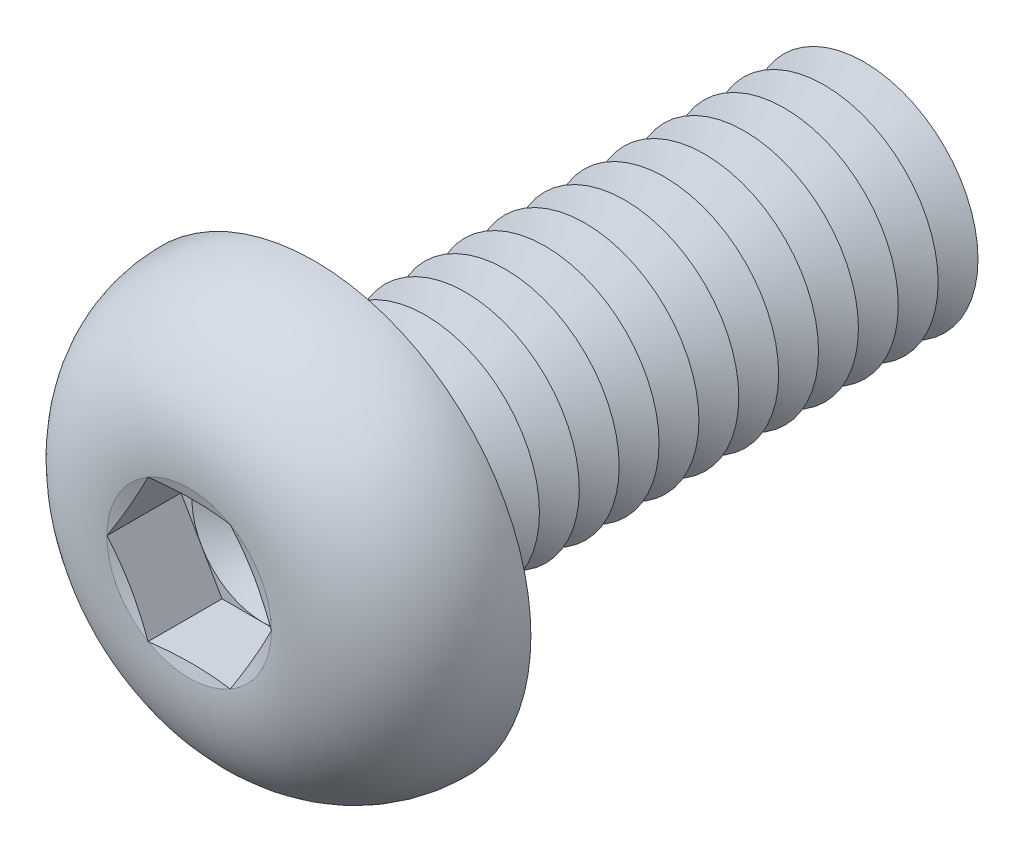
ISO-10303-21;
HEADER;
FILE_DESCRIPTION(('STEP AP214'),'2;1');
FILE_NAME('part.step','',(''),(''),'','','');
FILE_SCHEMA(('AUTOMOTIVE_DESIGN { 1 0 10303 214 1 1 1 1 }'));
ENDSEC;
DATA;
#1=APPLICATION_CONTEXT('core data for automotive mechanical design processes');
#2=APPLICATION_PROTOCOL_DEFINITION('international standard','automotive_design',2000,#1);
#3=PRODUCT_CONTEXT('',#1,'mechanical');
#4=PRODUCT('Part','Part','',(#3));
#5=PRODUCT_RELATED_PRODUCT_CATEGORY('part','',(#4));
#6=PRODUCT_DEFINITION_FORMATION('','',#4);
#7=PRODUCT_DEFINITION_CONTEXT('part definition',#1,'design');
#8=PRODUCT_DEFINITION('design','',#6,#7);
#9=PRODUCT_DEFINITION_SHAPE('','',#8);
#10=(LENGTH_UNIT() NAMED_UNIT(*) SI_UNIT(.MILLI.,.METRE.));
#11=(NAMED_UNIT(*) PLANE_ANGLE_UNIT() SI_UNIT($,.RADIAN.));
#12=(NAMED_UNIT(*) SI_UNIT($,.STERADIAN.) SOLID_ANGLE_UNIT());
#13=UNCERTAINTY_MEASURE_WITH_UNIT(LENGTH_MEASURE(1.E-05),#10,'distance_accuracy_value','');
#14=(GEOMETRIC_REPRESENTATION_CONTEXT(3) GLOBAL_UNCERTAINTY_ASSIGNED_CONTEXT((#13)) GLOBAL_UNIT_ASSIGNED_CONTEXT((#10,
#11,#12)) REPRESENTATION_CONTEXT('',''));
#15=CARTESIAN_POINT('',(0.,0.,0.));
#16=DIRECTION('',(0.,0.,1.));
#17=DIRECTION('',(1.,0.,0.));
#18=AXIS2_PLACEMENT_3D('',#15,#16,#17);
#19=CARTESIAN_POINT('',(0.,0.,0.9));
#20=DIRECTION('',(0.,0.,1.));
#21=DIRECTION('',(1.,0.,0.));
#22=AXIS2_PLACEMENT_3D('',#19,#20,#21);
#23=PLANE('',#22);
#24=CARTESIAN_POINT('',(0.,0.,0.9));
#25=DIRECTION('',(0.,0.,1.));
#26=DIRECTION('',(1.,0.,0.));
#27=AXIS2_PLACEMENT_3D('',#24,#25,#26);
#28=CIRCLE('',#27,1.24999941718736);
#29=CARTESIAN_POINT('',(1.08253125,0.624999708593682,0.9));
#30=VERTEX_POINT('',#29);
#31=CARTESIAN_POINT('',(0.,1.24999941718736,0.9));
#32=VERTEX_POINT('',#31);
#33=EDGE_CURVE('E118',#30,#32,#28,.T.);
#34=ORIENTED_EDGE('',*,*,#33,.F.);
#35=DIRECTION('',(-0.5,0.866025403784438,0.));
#36=VECTOR('',#35,1.);
#37=CARTESIAN_POINT('',(1.443375,0.,0.9));
#38=LINE('',#37,#36);
#39=CARTESIAN_POINT('',(0.7216875,1.24999941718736,0.9));
#40=VERTEX_POINT('',#39);
#41=EDGE_CURVE('E125',#30,#40,#38,.T.);
#42=ORIENTED_EDGE('',*,*,#41,.T.);
#43=DIRECTION('',(-1.,0.,0.));
#44=VECTOR('',#43,1.);
#45=CARTESIAN_POINT('',(0.7216875,1.24999941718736,0.9));
#46=LINE('',#45,#44);
#47=EDGE_CURVE('E136',#40,#32,#46,.T.);
#48=ORIENTED_EDGE('',*,*,#47,.T.);
#49=EDGE_LOOP('',(#34,#42,#48));
#50=FACE_BOUND('',#49,.T.);
#51=ADVANCED_FACE('F39',(#50),#23,.T.);
#52=CARTESIAN_POINT('',(0.,0.,0.9));
#53=DIRECTION('',(0.,0.,1.));
#54=DIRECTION('',(1.,0.,0.));
#55=AXIS2_PLACEMENT_3D('',#52,#53,#54);
#56=CIRCLE('',#55,1.24999941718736);
#57=CARTESIAN_POINT('',(-1.08253125,0.624999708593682,0.9));
#58=VERTEX_POINT('',#57);
#59=EDGE_CURVE('E11',#32,#58,#56,.T.);
#60=ORIENTED_EDGE('',*,*,#59,.F.);
#61=CARTESIAN_POINT('',(-0.721687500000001,1.24999941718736,0.9));
#62=VERTEX_POINT('',#61);
#63=EDGE_CURVE('E131',#32,#62,#46,.T.);
#64=ORIENTED_EDGE('',*,*,#63,.T.);
#65=DIRECTION('',(-0.5,-0.866025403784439,0.));
#66=VECTOR('',#65,1.);
#67=CARTESIAN_POINT('',(-0.721687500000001,1.24999941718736,0.9));
#68=LINE('',#67,#66);
#69=EDGE_CURVE('E134',#62,#58,#68,.T.);
#70=ORIENTED_EDGE('',*,*,#69,.T.);
#71=EDGE_LOOP('',(#60,#64,#70));
#72=FACE_BOUND('',#71,.T.);
#73=ADVANCED_FACE('F130',(#72),#23,.T.);
#74=CARTESIAN_POINT('',(-1.08253125,-0.624999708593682,0.9));
#75=VERTEX_POINT('',#74);
#76=EDGE_CURVE('E49',#58,#75,#56,.T.);
#77=ORIENTED_EDGE('',*,*,#76,.F.);
#78=CARTESIAN_POINT('',(-1.443375,0.,0.9));
#79=VERTEX_POINT('',#78);
#80=EDGE_CURVE('E143',#58,#79,#68,.T.);
#81=ORIENTED_EDGE('',*,*,#80,.T.);
#82=DIRECTION('',(0.5,-0.866025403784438,0.));
#83=VECTOR('',#82,1.);
#84=CARTESIAN_POINT('',(-1.443375,0.,0.9));
#85=LINE('',#84,#83);
#86=EDGE_CURVE('E152',#79,#75,#85,.T.);
#87=ORIENTED_EDGE('',*,*,#86,.T.);
#88=EDGE_LOOP('',(#77,#81,#87));
#89=FACE_BOUND('',#88,.T.);
#90=ADVANCED_FACE('F387',(#89),#23,.T.);
#91=CARTESIAN_POINT('',(0.,-1.24999941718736,0.9));
#92=VERTEX_POINT('',#91);
#93=EDGE_CURVE('E369',#75,#92,#56,.T.);
#94=ORIENTED_EDGE('',*,*,#93,.F.);
#95=CARTESIAN_POINT('',(-0.721687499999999,-1.24999941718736,0.9));
#96=VERTEX_POINT('',#95);
#97=EDGE_CURVE('E151',#75,#96,#85,.T.);
#98=ORIENTED_EDGE('',*,*,#97,.T.);
#99=DIRECTION('',(1.,0.,0.));
#100=VECTOR('',#99,1.);
#101=CARTESIAN_POINT('',(-0.721687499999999,-1.24999941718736,0.9));
#102=LINE('',#101,#100);
#103=EDGE_CURVE('E157',#96,#92,#102,.T.);
#104=ORIENTED_EDGE('',*,*,#103,.T.);
#105=EDGE_LOOP('',(#94,#98,#104));
#106=FACE_BOUND('',#105,.T.);
#107=ADVANCED_FACE('F381',(#106),#23,.T.);
#108=CARTESIAN_POINT('',(1.08253125,-0.624999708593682,0.9));
#109=VERTEX_POINT('',#108);
#110=EDGE_CURVE('E56',#92,#109,#56,.T.);
#111=ORIENTED_EDGE('',*,*,#110,.F.);
#112=CARTESIAN_POINT('',(0.721687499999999,-1.24999941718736,0.9));
#113=VERTEX_POINT('',#112);
#114=EDGE_CURVE('E156',#92,#113,#102,.T.);
#115=ORIENTED_EDGE('',*,*,#114,.T.);
#116=DIRECTION('',(0.5,0.866025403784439,0.));
#117=VECTOR('',#116,1.);
#118=CARTESIAN_POINT('',(0.721687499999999,-1.24999941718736,0.9));
#119=LINE('',#118,#117);
#120=EDGE_CURVE('E162',#113,#109,#119,.T.);
#121=ORIENTED_EDGE('',*,*,#120,.T.);
#122=EDGE_LOOP('',(#111,#115,#121));
#123=FACE_BOUND('',#122,.T.);
#124=ADVANCED_FACE('F452',(#123),#23,.T.);
#125=CARTESIAN_POINT('',(0.,0.,2.2));
#126=DIRECTION('',(0.,0.,1.));
#127=DIRECTION('',(1.,0.,0.));
#128=AXIS2_PLACEMENT_3D('',#125,#126,#127);
#129=CONICAL_SURFACE('',#128,1.443375,1.30899693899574);
#130=CARTESIAN_POINT('',(1.44349047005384,-0.000199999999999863,2.20003094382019));
#131=CARTESIAN_POINT('',(1.41351104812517,0.0517258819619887,2.19199301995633));
#132=CARTESIAN_POINT('',(1.38347725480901,0.10374593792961,2.18469579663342));
#133=CARTESIAN_POINT('',(1.32330355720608,0.207969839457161,2.17187512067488));
#134=CARTESIAN_POINT('',(1.29316361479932,0.260173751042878,2.16635238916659));
#135=CARTESIAN_POINT('',(1.23296043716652,0.364448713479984,2.15740323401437));
#136=CARTESIAN_POINT('',(1.20289760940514,0.416519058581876,2.15396613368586));
#137=CARTESIAN_POINT('',(1.14273359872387,0.520726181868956,2.14935732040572));
#138=CARTESIAN_POINT('',(1.11263242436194,0.572862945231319,2.14818516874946));
#139=CARTESIAN_POINT('',(1.05243007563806,0.677136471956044,2.14818516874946));
#140=CARTESIAN_POINT('',(1.02232890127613,0.729273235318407,2.14935732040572));
#141=CARTESIAN_POINT('',(0.962164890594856,0.833480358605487,2.15396613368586));
#142=CARTESIAN_POINT('',(0.932102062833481,0.885550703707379,2.15740323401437));
#143=CARTESIAN_POINT('',(0.87189888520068,0.989825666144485,2.16635238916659));
#144=CARTESIAN_POINT('',(0.841758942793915,1.0420295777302,2.17187512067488));
#145=CARTESIAN_POINT('',(0.781585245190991,1.14625347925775,2.18469579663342));
#146=CARTESIAN_POINT('',(0.751551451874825,1.19827353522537,2.19199301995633));
#147=CARTESIAN_POINT('',(0.721572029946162,1.25019941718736,2.20003094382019));
#148=B_SPLINE_CURVE_WITH_KNOTS('',3,(#130,#131,#132,#133,#134,#135,#136,#137,#138,#139,#140,
#141,#142,#143,#144,#145,#146,#147),.UNSPECIFIED.,.F.,.F.,(4,2,2,2,2,2,2,2,4),(0.,
0.181495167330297,0.363063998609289,0.543695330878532,0.724291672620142,0.904888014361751,
1.08551934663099,1.26708817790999,1.44858334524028),.UNSPECIFIED.);
#149=CARTESIAN_POINT('',(1.443375,0.,2.2));
#150=VERTEX_POINT('',#149);
#151=CARTESIAN_POINT('',(0.721687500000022,1.24999941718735,2.2));
#152=VERTEX_POINT('',#151);
#153=EDGE_CURVE('E222',#150,#152,#148,.T.);
#154=ORIENTED_EDGE('',*,*,#153,.F.);
#155=CARTESIAN_POINT('',(0.,0.,2.2));
#156=DIRECTION('',(0.,0.,-1.));
#157=DIRECTION('',(-1.,0.,0.));
#158=AXIS2_PLACEMENT_3D('',#155,#156,#157);
#159=CIRCLE('',#158,1.443375);
#160=EDGE_CURVE('E417',#152,#150,#159,.T.);
#161=ORIENTED_EDGE('',*,*,#160,.F.);
#162=EDGE_LOOP('',(#154,#161));
#163=FACE_BOUND('',#162,.T.);
#164=ADVANCED_FACE('F456',(#163),#129,.F.);
#165=CARTESIAN_POINT('',(0.721572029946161,-1.25019941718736,2.20003094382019));
#166=CARTESIAN_POINT('',(0.751551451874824,-1.19827353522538,2.19199301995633));
#167=CARTESIAN_POINT('',(0.78158524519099,-1.14625347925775,2.18469579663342));
#168=CARTESIAN_POINT('',(0.841758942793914,-1.0420295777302,2.17187512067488));
#169=CARTESIAN_POINT('',(0.87189888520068,-0.989825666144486,2.16635238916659));
#170=CARTESIAN_POINT('',(0.932102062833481,-0.88555070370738,2.15740323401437));
#171=CARTESIAN_POINT('',(0.962164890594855,-0.833480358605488,2.15396613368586));
#172=CARTESIAN_POINT('',(1.02232890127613,-0.729273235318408,2.14935732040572));
#173=CARTESIAN_POINT('',(1.05243007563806,-0.677136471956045,2.14818516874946));
#174=CARTESIAN_POINT('',(1.11263242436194,-0.572862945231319,2.14818516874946));
#175=CARTESIAN_POINT('',(1.14273359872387,-0.520726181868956,2.14935732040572));
#176=CARTESIAN_POINT('',(1.20289760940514,-0.416519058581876,2.15396613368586));
#177=CARTESIAN_POINT('',(1.23296043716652,-0.364448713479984,2.15740323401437));
#178=CARTESIAN_POINT('',(1.29316361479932,-0.260173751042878,2.16635238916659));
#179=CARTESIAN_POINT('',(1.32330355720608,-0.207969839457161,2.17187512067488));
#180=CARTESIAN_POINT('',(1.38347725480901,-0.10374593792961,2.18469579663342));
#181=CARTESIAN_POINT('',(1.41351104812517,-0.0517258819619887,2.19199301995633));
#182=CARTESIAN_POINT('',(1.44349047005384,0.000199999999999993,2.20003094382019));
#183=B_SPLINE_CURVE_WITH_KNOTS('',3,(#165,#166,#167,#168,#169,#170,#171,#172,#173,#174,#175,
#176,#177,#178,#179,#180,#181,#182),.UNSPECIFIED.,.F.,.F.,(4,2,2,2,2,2,2,2,4),(0.,
0.181495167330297,0.36306399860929,0.543695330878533,0.724291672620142,0.904888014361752,
1.085519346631,1.26708817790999,1.44858334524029),.UNSPECIFIED.);
#184=CARTESIAN_POINT('',(0.721687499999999,-1.24999941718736,2.2));
#185=VERTEX_POINT('',#184);
#186=EDGE_CURVE('E231',#185,#150,#183,.T.);
#187=ORIENTED_EDGE('',*,*,#186,.F.);
#188=EDGE_CURVE('E418',#150,#185,#159,.T.);
#189=ORIENTED_EDGE('',*,*,#188,.F.);
#190=EDGE_LOOP('',(#187,#189));
#191=FACE_BOUND('',#190,.T.);
#192=ADVANCED_FACE('F462',(#191),#129,.F.);
#193=CARTESIAN_POINT('',(-2.17815859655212,-1.24999941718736,2.48616275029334));
#194=CARTESIAN_POINT('',(-2.07269794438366,-1.24999941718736,2.4616881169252));
#195=CARTESIAN_POINT('',(-1.96714913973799,-1.24999941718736,2.43756889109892));
#196=CARTESIAN_POINT('',(-1.75576352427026,-1.24999941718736,2.39052699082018));
#197=CARTESIAN_POINT('',(-1.64992665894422,-1.24999941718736,2.36760456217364));
#198=CARTESIAN_POINT('',(-1.43690237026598,-1.24999941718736,2.3232454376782));
#199=CARTESIAN_POINT('',(-1.32971158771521,-1.24999941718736,2.30182468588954));
#200=CARTESIAN_POINT('',(-1.1148274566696,-1.24999941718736,2.26156703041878));
#201=CARTESIAN_POINT('',(-1.00713406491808,-1.24999941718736,2.24273035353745));
#202=CARTESIAN_POINT('',(-0.794044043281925,-1.24999941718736,2.2093913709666));
#203=CARTESIAN_POINT('',(-0.688664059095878,-1.24999941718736,2.19478562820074));
#204=CARTESIAN_POINT('',(-0.477310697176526,-1.24999941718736,2.17085809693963));
#205=CARTESIAN_POINT('',(-0.371337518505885,-1.24999941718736,2.16153463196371));
#206=CARTESIAN_POINT('',(-0.159455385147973,-1.24999941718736,2.14976770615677));
#207=CARTESIAN_POINT('',(-0.0535482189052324,-1.24999941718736,2.14729400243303));
#208=CARTESIAN_POINT('',(0.158189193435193,-1.24999941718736,2.14966287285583));
#209=CARTESIAN_POINT('',(0.264019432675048,-1.24999941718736,2.15450603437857));
#210=CARTESIAN_POINT('',(0.445148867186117,-1.24999941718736,2.16825380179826));
#211=CARTESIAN_POINT('',(0.520574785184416,-1.24999941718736,2.17561242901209));
#212=CARTESIAN_POINT('',(0.671115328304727,-1.24999941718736,2.19297000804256));
#213=CARTESIAN_POINT('',(0.746229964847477,-1.24999941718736,2.20296886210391));
#214=CARTESIAN_POINT('',(0.896387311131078,-1.24999941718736,2.22505910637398));
#215=CARTESIAN_POINT('',(0.971429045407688,-1.24999941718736,2.23715700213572));
#216=CARTESIAN_POINT('',(1.12124320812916,-1.24999941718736,2.26292371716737));
#217=CARTESIAN_POINT('',(1.19601562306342,-1.24999941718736,2.27659261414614));
#218=CARTESIAN_POINT('',(1.34686913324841,-1.24999941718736,2.30540811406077));
#219=CARTESIAN_POINT('',(1.42294548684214,-1.24999941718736,2.32057934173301));
#220=CARTESIAN_POINT('',(1.57490676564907,-1.24999941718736,2.351851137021));
#221=CARTESIAN_POINT('',(1.65079168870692,-1.24999941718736,2.36795171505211));
#222=CARTESIAN_POINT('',(1.80199501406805,-1.24999941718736,2.40076814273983));
#223=CARTESIAN_POINT('',(1.87731425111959,-1.24999941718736,2.41748016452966));
#224=CARTESIAN_POINT('',(2.02782424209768,-1.24999941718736,2.45144971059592));
#225=CARTESIAN_POINT('',(2.10301500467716,-1.24999941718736,2.46870719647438));
#226=CARTESIAN_POINT('',(2.17815859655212,-1.24999941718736,2.48616275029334));
#227=B_SPLINE_CURVE_WITH_KNOTS('',3,(#193,#194,#195,#196,#197,#198,#199,#200,#201,#202,#203,
#204,#205,#206,#207,#208,#209,#210,#211,#212,#213,#214,#215,#216,#217,#218,#219,#220,#221,#222,
#223,#224,#225,#226),.UNSPECIFIED.,.F.,.F.,(4,2,2,2,2,2,2,2,2,2,2,2,2,2,2,2,4),(0.,
0.324797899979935,0.649662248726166,0.977572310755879,1.30551113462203,1.62458166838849,
1.94355087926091,2.26110952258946,2.57869365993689,2.80599541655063,3.03328875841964,
3.2612995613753,3.48932164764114,3.7220371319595,3.95475522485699,4.18620606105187,
4.41764064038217),.UNSPECIFIED.);
#228=CARTESIAN_POINT('',(-0.721687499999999,-1.24999941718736,2.2));
#229=VERTEX_POINT('',#228);
#230=EDGE_CURVE('E399',#229,#185,#227,.T.);
#231=ORIENTED_EDGE('',*,*,#230,.F.);
#232=EDGE_CURVE('E407',#185,#229,#159,.T.);
#233=ORIENTED_EDGE('',*,*,#232,.F.);
#234=EDGE_LOOP('',(#231,#233));
#235=FACE_BOUND('',#234,.T.);
#236=ADVANCED_FACE('F476',(#235),#129,.F.);
#237=CARTESIAN_POINT('',(-1.44349047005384,0.000200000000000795,2.20003094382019));
#238=CARTESIAN_POINT('',(-1.41351104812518,-0.0517258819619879,2.19199301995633));
#239=CARTESIAN_POINT('',(-1.38347725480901,-0.10374593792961,2.18469579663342));
#240=CARTESIAN_POINT('',(-1.32330355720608,-0.20796983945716,2.17187512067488));
#241=CARTESIAN_POINT('',(-1.29316361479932,-0.260173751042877,2.16635238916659));
#242=CARTESIAN_POINT('',(-1.23296043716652,-0.364448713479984,2.15740323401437));
#243=CARTESIAN_POINT('',(-1.20289760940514,-0.416519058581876,2.15396613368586));
#244=CARTESIAN_POINT('',(-1.14273359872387,-0.520726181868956,2.14935732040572));
#245=CARTESIAN_POINT('',(-1.11263242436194,-0.572862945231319,2.14818516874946));
#246=CARTESIAN_POINT('',(-1.05243007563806,-0.677136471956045,2.14818516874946));
#247=CARTESIAN_POINT('',(-1.02232890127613,-0.729273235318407,2.14935732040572));
#248=CARTESIAN_POINT('',(-0.962164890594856,-0.833480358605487,2.15396613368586));
#249=CARTESIAN_POINT('',(-0.932102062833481,-0.885550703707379,2.15740323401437));
#250=CARTESIAN_POINT('',(-0.87189888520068,-0.989825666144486,2.16635238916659));
#251=CARTESIAN_POINT('',(-0.841758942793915,-1.0420295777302,2.17187512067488));
#252=CARTESIAN_POINT('',(-0.78158524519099,-1.14625347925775,2.18469579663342));
#253=CARTESIAN_POINT('',(-0.751551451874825,-1.19827353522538,2.19199301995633));
#254=CARTESIAN_POINT('',(-0.721572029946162,-1.25019941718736,2.20003094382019));
#255=B_SPLINE_CURVE_WITH_KNOTS('',3,(#237,#238,#239,#240,#241,#242,#243,#244,#245,#246,#247,
#248,#249,#250,#251,#252,#253,#254),.UNSPECIFIED.,.F.,.F.,(4,2,2,2,2,2,2,2,4),(0.,
0.181495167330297,0.36306399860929,0.543695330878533,0.724291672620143,0.904888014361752,
1.085519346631,1.26708817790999,1.44858334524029),.UNSPECIFIED.);
#256=CARTESIAN_POINT('',(-1.443375,0.,2.2));
#257=VERTEX_POINT('',#256);
#258=EDGE_CURVE('E392',#257,#229,#255,.T.);
#259=ORIENTED_EDGE('',*,*,#258,.F.);
#260=EDGE_CURVE('E348',#229,#257,#159,.T.);
#261=ORIENTED_EDGE('',*,*,#260,.F.);
#262=EDGE_LOOP('',(#259,#261));
#263=FACE_BOUND('',#262,.T.);
#264=ADVANCED_FACE('F396',(#263),#129,.F.);
#265=CARTESIAN_POINT('',(-0.721572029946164,1.25019941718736,2.20003094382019));
#266=CARTESIAN_POINT('',(-0.751551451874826,1.19827353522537,2.19199301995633));
#267=CARTESIAN_POINT('',(-0.781585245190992,1.14625347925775,2.18469579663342));
#268=CARTESIAN_POINT('',(-0.841758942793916,1.0420295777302,2.17187512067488));
#269=CARTESIAN_POINT('',(-0.871898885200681,0.989825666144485,2.16635238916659));
#270=CARTESIAN_POINT('',(-0.932102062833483,0.885550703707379,2.15740323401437));
#271=CARTESIAN_POINT('',(-0.962164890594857,0.833480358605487,2.15396613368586));
#272=CARTESIAN_POINT('',(-1.02232890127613,0.729273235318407,2.14935732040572));
#273=CARTESIAN_POINT('',(-1.05243007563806,0.677136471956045,2.14818516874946));
#274=CARTESIAN_POINT('',(-1.11263242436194,0.572862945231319,2.14818516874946));
#275=CARTESIAN_POINT('',(-1.14273359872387,0.520726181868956,2.14935732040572));
#276=CARTESIAN_POINT('',(-1.20289760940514,0.416519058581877,2.15396613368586));
#277=CARTESIAN_POINT('',(-1.23296043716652,0.364448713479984,2.15740323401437));
#278=CARTESIAN_POINT('',(-1.29316361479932,0.260173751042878,2.16635238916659));
#279=CARTESIAN_POINT('',(-1.32330355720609,0.207969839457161,2.17187512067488));
#280=CARTESIAN_POINT('',(-1.38347725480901,0.103745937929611,2.18469579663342));
#281=CARTESIAN_POINT('',(-1.41351104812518,0.0517258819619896,2.19199301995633));
#282=CARTESIAN_POINT('',(-1.44349047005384,-0.00019999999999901,2.20003094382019));
#283=B_SPLINE_CURVE_WITH_KNOTS('',3,(#265,#266,#267,#268,#269,#270,#271,#272,#273,#274,#275,
#276,#277,#278,#279,#280,#281,#282),.UNSPECIFIED.,.F.,.F.,(4,2,2,2,2,2,2,2,4),(0.,
0.181495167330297,0.363063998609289,0.543695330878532,0.724291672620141,0.90488801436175,
1.08551934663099,1.26708817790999,1.44858334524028),.UNSPECIFIED.);
#284=CARTESIAN_POINT('',(-0.721687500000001,1.24999941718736,2.2));
#285=VERTEX_POINT('',#284);
#286=EDGE_CURVE('E195',#285,#257,#283,.T.);
#287=ORIENTED_EDGE('',*,*,#286,.F.);
#288=EDGE_CURVE('E349',#257,#285,#159,.T.);
#289=ORIENTED_EDGE('',*,*,#288,.F.);
#290=EDGE_LOOP('',(#287,#289));
#291=FACE_BOUND('',#290,.T.);
#292=ADVANCED_FACE('F410',(#291),#129,.F.);
#293=CARTESIAN_POINT('',(0.,0.,-7.55));
#294=DIRECTION('',(0.,0.,1.));
#295=DIRECTION('',(1.,0.,0.));
#296=AXIS2_PLACEMENT_3D('',#293,#294,#295);
#297=CONICAL_SURFACE('',#296,2.,1.0471975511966);
#298=CARTESIAN_POINT('',(0.,0.,-7.9));
#299=DIRECTION('',(0.,0.,1.));
#300=DIRECTION('',(1.,0.,0.));
#301=AXIS2_PLACEMENT_3D('',#298,#299,#300);
#302=CIRCLE('',#301,1.3937822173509);
#303=CARTESIAN_POINT('',(1.3937822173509,0.,-7.9));
#304=VERTEX_POINT('',#303);
#305=EDGE_CURVE('E320',#304,#304,#302,.T.);
#306=ORIENTED_EDGE('',*,*,#305,.T.);
#307=EDGE_LOOP('',(#306));
#308=FACE_BOUND('',#307,.T.);
#309=CARTESIAN_POINT('',(0.,0.,-7.55));
#310=DIRECTION('',(0.,0.,1.));
#311=DIRECTION('',(1.,0.,0.));
#312=AXIS2_PLACEMENT_3D('',#309,#310,#311);
#313=CIRCLE('',#312,2.);
#314=CARTESIAN_POINT('',(2.,0.,-7.55));
#315=VERTEX_POINT('',#314);
#316=EDGE_CURVE('E316',#315,#315,#313,.T.);
#317=ORIENTED_EDGE('',*,*,#316,.F.);
#318=EDGE_LOOP('',(#317));
#319=FACE_BOUND('',#318,.T.);
#320=ADVANCED_FACE('F542',(#308,#319),#297,.T.);
#321=CARTESIAN_POINT('',(0.,0.,-7.9));
#322=DIRECTION('',(0.,0.,-1.));
#323=DIRECTION('',(-1.,0.,0.));
#324=AXIS2_PLACEMENT_3D('',#321,#322,#323);
#325=CONICAL_SURFACE('',#324,1.3937822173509,1.0471975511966);
#326=CARTESIAN_POINT('',(0.,0.,-8.25));
#327=DIRECTION('',(0.,0.,1.));
#328=DIRECTION('',(1.,0.,0.));
#329=AXIS2_PLACEMENT_3D('',#326,#327,#328);
#330=CIRCLE('',#329,2.);
#331=CARTESIAN_POINT('',(2.,0.,-8.25));
#332=VERTEX_POINT('',#331);
#333=EDGE_CURVE('E324',#332,#332,#330,.T.);
#334=ORIENTED_EDGE('',*,*,#333,.T.);
#335=EDGE_LOOP('',(#334));
#336=FACE_BOUND('',#335,.T.);
#337=ORIENTED_EDGE('',*,*,#305,.F.);
#338=EDGE_LOOP('',(#337));
#339=FACE_BOUND('',#338,.T.);
#340=ADVANCED_FACE('F817',(#336,#339),#325,.T.);
#341=CARTESIAN_POINT('',(0.,2.00000000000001,-10.));
#342=DIRECTION('',(0.,0.,-1.));
#343=DIRECTION('',(-1.,0.,0.));
#344=AXIS2_PLACEMENT_3D('',#341,#342,#343);
#345=PLANE('',#344);
#346=CARTESIAN_POINT('',(0.,0.,-10.));
#347=DIRECTION('',(0.,0.,1.));
#348=DIRECTION('',(1.,0.,0.));
#349=AXIS2_PLACEMENT_3D('',#346,#347,#348);
#350=CIRCLE('',#349,1.3937822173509);
#351=CARTESIAN_POINT('',(1.3937822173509,0.,-10.));
#352=VERTEX_POINT('',#351);
#353=EDGE_CURVE('E344',#352,#352,#350,.T.);
#354=ORIENTED_EDGE('',*,*,#353,.F.);
#355=EDGE_LOOP('',(#354));
#356=FACE_BOUND('',#355,.T.);
#357=ADVANCED_FACE('F811',(#356),#345,.T.);
#358=CARTESIAN_POINT('',(0.,0.,-9.65));
#359=DIRECTION('',(0.,0.,1.));
#360=DIRECTION('',(1.,0.,0.));
#361=AXIS2_PLACEMENT_3D('',#358,#359,#360);
#362=CONICAL_SURFACE('',#361,2.,1.0471975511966);
#363=ORIENTED_EDGE('',*,*,#353,.T.);
#364=EDGE_LOOP('',(#363));
#365=FACE_BOUND('',#364,.T.);
#366=CARTESIAN_POINT('',(0.,0.,-9.65));
#367=DIRECTION('',(0.,0.,1.));
#368=DIRECTION('',(1.,0.,0.));
#369=AXIS2_PLACEMENT_3D('',#366,#367,#368);
#370=CIRCLE('',#369,2.);
#371=CARTESIAN_POINT('',(2.,0.,-9.65));
#372=VERTEX_POINT('',#371);
#373=EDGE_CURVE('E340',#372,#372,#370,.T.);
#374=ORIENTED_EDGE('',*,*,#373,.F.);
#375=EDGE_LOOP('',(#374));
#376=FACE_BOUND('',#375,.T.);
#377=ADVANCED_FACE('F804',(#365,#376),#362,.T.);
#378=CARTESIAN_POINT('',(0.,0.,-9.3));
#379=DIRECTION('',(0.,0.,-1.));
#380=DIRECTION('',(-1.,0.,0.));
#381=AXIS2_PLACEMENT_3D('',#378,#379,#380);
#382=CONICAL_SURFACE('',#381,1.3937822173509,1.0471975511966);
#383=ORIENTED_EDGE('',*,*,#373,.T.);
#384=EDGE_LOOP('',(#383));
#385=FACE_BOUND('',#384,.T.);
#386=CARTESIAN_POINT('',(0.,0.,-9.3));
#387=DIRECTION('',(0.,0.,1.));
#388=DIRECTION('',(1.,0.,0.));
#389=AXIS2_PLACEMENT_3D('',#386,#387,#388);
#390=CIRCLE('',#389,1.3937822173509);
#391=CARTESIAN_POINT('',(1.3937822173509,0.,-9.3));
#392=VERTEX_POINT('',#391);
#393=EDGE_CURVE('E336',#392,#392,#390,.T.);
#394=ORIENTED_EDGE('',*,*,#393,.F.);
#395=EDGE_LOOP('',(#394));
#396=FACE_BOUND('',#395,.T.);
#397=ADVANCED_FACE('F797',(#385,#396),#382,.T.);
#398=CARTESIAN_POINT('',(0.,0.,-8.95));
#399=DIRECTION('',(0.,0.,1.));
#400=DIRECTION('',(1.,0.,0.));
#401=AXIS2_PLACEMENT_3D('',#398,#399,#400);
#402=CONICAL_SURFACE('',#401,2.,1.0471975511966);
#403=ORIENTED_EDGE('',*,*,#393,.T.);
#404=EDGE_LOOP('',(#403));
#405=FACE_BOUND('',#404,.T.);
#406=CARTESIAN_POINT('',(0.,0.,-8.95));
#407=DIRECTION('',(0.,0.,1.));
#408=DIRECTION('',(1.,0.,0.));
#409=AXIS2_PLACEMENT_3D('',#406,#407,#408);
#410=CIRCLE('',#409,2.);
#411=CARTESIAN_POINT('',(2.,0.,-8.95));
#412=VERTEX_POINT('',#411);
#413=EDGE_CURVE('E332',#412,#412,#410,.T.);
#414=ORIENTED_EDGE('',*,*,#413,.F.);
#415=EDGE_LOOP('',(#414));
#416=FACE_BOUND('',#415,.T.);
#417=ADVANCED_FACE('F790',(#405,#416),#402,.T.);
#418=CARTESIAN_POINT('',(0.,0.,-8.6));
#419=DIRECTION('',(0.,0.,-1.));
#420=DIRECTION('',(-1.,0.,0.));
#421=AXIS2_PLACEMENT_3D('',#418,#419,#420);
#422=CONICAL_SURFACE('',#421,1.3937822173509,1.0471975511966);
#423=ORIENTED_EDGE('',*,*,#413,.T.);
#424=EDGE_LOOP('',(#423));
#425=FACE_BOUND('',#424,.T.);
#426=CARTESIAN_POINT('',(0.,0.,-8.6));
#427=DIRECTION('',(0.,0.,1.));
#428=DIRECTION('',(1.,0.,0.));
#429=AXIS2_PLACEMENT_3D('',#426,#427,#428);
#430=CIRCLE('',#429,1.3937822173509);
#431=CARTESIAN_POINT('',(1.3937822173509,0.,-8.6));
#432=VERTEX_POINT('',#431);
#433=EDGE_CURVE('E328',#432,#432,#430,.T.);
#434=ORIENTED_EDGE('',*,*,#433,.F.);
#435=EDGE_LOOP('',(#434));
#436=FACE_BOUND('',#435,.T.);
#437=ADVANCED_FACE('F783',(#425,#436),#422,.T.);
#438=CARTESIAN_POINT('',(0.,0.,-8.25));
#439=DIRECTION('',(0.,0.,1.));
#440=DIRECTION('',(1.,0.,0.));
#441=AXIS2_PLACEMENT_3D('',#438,#439,#440);
#442=CONICAL_SURFACE('',#441,2.,1.0471975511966);
#443=ORIENTED_EDGE('',*,*,#433,.T.);
#444=EDGE_LOOP('',(#443));
#445=FACE_BOUND('',#444,.T.);
#446=ORIENTED_EDGE('',*,*,#333,.F.);
#447=EDGE_LOOP('',(#446));
#448=FACE_BOUND('',#447,.T.);
#449=ADVANCED_FACE('F776',(#445,#448),#442,.T.);
#450=CARTESIAN_POINT('',(0.,0.,-6.85));
#451=DIRECTION('',(0.,0.,1.));
#452=DIRECTION('',(1.,0.,0.));
#453=AXIS2_PLACEMENT_3D('',#450,#451,#452);
#454=CONICAL_SURFACE('',#453,2.,1.0471975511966);
#455=CARTESIAN_POINT('',(0.,0.,-7.2));
#456=DIRECTION('',(0.,0.,1.));
#457=DIRECTION('',(1.,0.,0.));
#458=AXIS2_PLACEMENT_3D('',#455,#456,#457);
#459=CIRCLE('',#458,1.3937822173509);
#460=CARTESIAN_POINT('',(1.3937822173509,0.,-7.2));
#461=VERTEX_POINT('',#460);
#462=EDGE_CURVE('E312',#461,#461,#459,.T.);
#463=ORIENTED_EDGE('',*,*,#462,.T.);
#464=EDGE_LOOP('',(#463));
#465=FACE_BOUND('',#464,.T.);
#466=CARTESIAN_POINT('',(0.,0.,-6.85));
#467=DIRECTION('',(0.,0.,1.));
#468=DIRECTION('',(1.,0.,0.));
#469=AXIS2_PLACEMENT_3D('',#466,#467,#468);
#470=CIRCLE('',#469,2.);
#471=CARTESIAN_POINT('',(2.,0.,-6.85));
#472=VERTEX_POINT('',#471);
#473=EDGE_CURVE('E308',#472,#472,#470,.T.);
#474=ORIENTED_EDGE('',*,*,#473,.F.);
#475=EDGE_LOOP('',(#474));
#476=FACE_BOUND('',#475,.T.);
#477=ADVANCED_FACE('F769',(#465,#476),#454,.T.);
#478=CARTESIAN_POINT('',(0.,0.,-7.2));
#479=DIRECTION('',(0.,0.,-1.));
#480=DIRECTION('',(-1.,0.,0.));
#481=AXIS2_PLACEMENT_3D('',#478,#479,#480);
#482=CONICAL_SURFACE('',#481,1.3937822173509,1.0471975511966);
#483=ORIENTED_EDGE('',*,*,#316,.T.);
#484=EDGE_LOOP('',(#483));
#485=FACE_BOUND('',#484,.T.);
#486=ORIENTED_EDGE('',*,*,#462,.F.);
#487=EDGE_LOOP('',(#486));
#488=FACE_BOUND('',#487,.T.);
#489=ADVANCED_FACE('F762',(#485,#488),#482,.T.);
#490=CARTESIAN_POINT('',(0.,0.,-6.15));
#491=DIRECTION('',(0.,0.,1.));
#492=DIRECTION('',(1.,0.,0.));
#493=AXIS2_PLACEMENT_3D('',#490,#491,#492);
#494=CONICAL_SURFACE('',#493,2.,1.0471975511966);
#495=CARTESIAN_POINT('',(0.,0.,-6.5));
#496=DIRECTION('',(0.,0.,1.));
#497=DIRECTION('',(1.,0.,0.));
#498=AXIS2_PLACEMENT_3D('',#495,#496,#497);
#499=CIRCLE('',#498,1.3937822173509);
#500=CARTESIAN_POINT('',(1.3937822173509,0.,-6.5));
#501=VERTEX_POINT('',#500);
#502=EDGE_CURVE('E304',#501,#501,#499,.T.);
#503=ORIENTED_EDGE('',*,*,#502,.T.);
#504=EDGE_LOOP('',(#503));
#505=FACE_BOUND('',#504,.T.);
#506=CARTESIAN_POINT('',(0.,0.,-6.15));
#507=DIRECTION('',(0.,0.,1.));
#508=DIRECTION('',(1.,0.,0.));
#509=AXIS2_PLACEMENT_3D('',#506,#507,#508);
#510=CIRCLE('',#509,2.);
#511=CARTESIAN_POINT('',(2.,0.,-6.15));
#512=VERTEX_POINT('',#511);
#513=EDGE_CURVE('E300',#512,#512,#510,.T.);
#514=ORIENTED_EDGE('',*,*,#513,.F.);
#515=EDGE_LOOP('',(#514));
#516=FACE_BOUND('',#515,.T.);
#517=ADVANCED_FACE('F755',(#505,#516),#494,.T.);
#518=CARTESIAN_POINT('',(0.,0.,-6.5));
#519=DIRECTION('',(0.,0.,-1.));
#520=DIRECTION('',(-1.,0.,0.));
#521=AXIS2_PLACEMENT_3D('',#518,#519,#520);
#522=CONICAL_SURFACE('',#521,1.3937822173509,1.0471975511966);
#523=ORIENTED_EDGE('',*,*,#473,.T.);
#524=EDGE_LOOP('',(#523));
#525=FACE_BOUND('',#524,.T.);
#526=ORIENTED_EDGE('',*,*,#502,.F.);
#527=EDGE_LOOP('',(#526));
#528=FACE_BOUND('',#527,.T.);
#529=ADVANCED_FACE('F748',(#525,#528),#522,.T.);
#530=CARTESIAN_POINT('',(0.,0.,-5.45));
#531=DIRECTION('',(0.,0.,1.));
#532=DIRECTION('',(1.,0.,0.));
#533=AXIS2_PLACEMENT_3D('',#530,#531,#532);
#534=CONICAL_SURFACE('',#533,2.,1.0471975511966);
#535=CARTESIAN_POINT('',(0.,0.,-5.8));
#536=DIRECTION('',(0.,0.,1.));
#537=DIRECTION('',(1.,0.,0.));
#538=AXIS2_PLACEMENT_3D('',#535,#536,#537);
#539=CIRCLE('',#538,1.3937822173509);
#540=CARTESIAN_POINT('',(1.3937822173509,0.,-5.8));
#541=VERTEX_POINT('',#540);
#542=EDGE_CURVE('E296',#541,#541,#539,.T.);
#543=ORIENTED_EDGE('',*,*,#542,.T.);
#544=EDGE_LOOP('',(#543));
#545=FACE_BOUND('',#544,.T.);
#546=CARTESIAN_POINT('',(0.,0.,-5.45));
#547=DIRECTION('',(0.,0.,1.));
#548=DIRECTION('',(1.,0.,0.));
#549=AXIS2_PLACEMENT_3D('',#546,#547,#548);
#550=CIRCLE('',#549,2.);
#551=CARTESIAN_POINT('',(2.,0.,-5.45));
#552=VERTEX_POINT('',#551);
#553=EDGE_CURVE('E292',#552,#552,#550,.T.);
#554=ORIENTED_EDGE('',*,*,#553,.F.);
#555=EDGE_LOOP('',(#554));
#556=FACE_BOUND('',#555,.T.);
#557=ADVANCED_FACE('F741',(#545,#556),#534,.T.);
#558=CARTESIAN_POINT('',(0.,0.,-5.8));
#559=DIRECTION('',(0.,0.,-1.));
#560=DIRECTION('',(-1.,0.,0.));
#561=AXIS2_PLACEMENT_3D('',#558,#559,#560);
#562=CONICAL_SURFACE('',#561,1.3937822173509,1.0471975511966);
#563=ORIENTED_EDGE('',*,*,#513,.T.);
#564=EDGE_LOOP('',(#563));
#565=FACE_BOUND('',#564,.T.);
#566=ORIENTED_EDGE('',*,*,#542,.F.);
#567=EDGE_LOOP('',(#566));
#568=FACE_BOUND('',#567,.T.);
#569=ADVANCED_FACE('F734',(#565,#568),#562,.T.);
#570=CARTESIAN_POINT('',(0.,0.,-4.75));
#571=DIRECTION('',(0.,0.,1.));
#572=DIRECTION('',(1.,0.,0.));
#573=AXIS2_PLACEMENT_3D('',#570,#571,#572);
#574=CONICAL_SURFACE('',#573,2.,1.0471975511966);
#575=CARTESIAN_POINT('',(0.,0.,-5.1));
#576=DIRECTION('',(0.,0.,1.));
#577=DIRECTION('',(1.,0.,0.));
#578=AXIS2_PLACEMENT_3D('',#575,#576,#577);
#579=CIRCLE('',#578,1.3937822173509);
#580=CARTESIAN_POINT('',(1.3937822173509,0.,-5.1));
#581=VERTEX_POINT('',#580);
#582=EDGE_CURVE('E288',#581,#581,#579,.T.);
#583=ORIENTED_EDGE('',*,*,#582,.T.);
#584=EDGE_LOOP('',(#583));
#585=FACE_BOUND('',#584,.T.);
#586=CARTESIAN_POINT('',(0.,0.,-4.75));
#587=DIRECTION('',(0.,0.,1.));
#588=DIRECTION('',(1.,0.,0.));
#589=AXIS2_PLACEMENT_3D('',#586,#587,#588);
#590=CIRCLE('',#589,2.);
#591=CARTESIAN_POINT('',(2.,0.,-4.75));
#592=VERTEX_POINT('',#591);
#593=EDGE_CURVE('E284',#592,#592,#590,.T.);
#594=ORIENTED_EDGE('',*,*,#593,.F.);
#595=EDGE_LOOP('',(#594));
#596=FACE_BOUND('',#595,.T.);
#597=ADVANCED_FACE('F727',(#585,#596),#574,.T.);
#598=CARTESIAN_POINT('',(0.,0.,-5.1));
#599=DIRECTION('',(0.,0.,-1.));
#600=DIRECTION('',(-1.,0.,0.));
#601=AXIS2_PLACEMENT_3D('',#598,#599,#600);
#602=CONICAL_SURFACE('',#601,1.3937822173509,1.0471975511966);
#603=ORIENTED_EDGE('',*,*,#553,.T.);
#604=EDGE_LOOP('',(#603));
#605=FACE_BOUND('',#604,.T.);
#606=ORIENTED_EDGE('',*,*,#582,.F.);
#607=EDGE_LOOP('',(#606));
#608=FACE_BOUND('',#607,.T.);
#609=ADVANCED_FACE('F720',(#605,#608),#602,.T.);
#610=CARTESIAN_POINT('',(0.,0.,-4.05));
#611=DIRECTION('',(0.,0.,1.));
#612=DIRECTION('',(1.,0.,0.));
#613=AXIS2_PLACEMENT_3D('',#610,#611,#612);
#614=CONICAL_SURFACE('',#613,2.,1.0471975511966);
#615=CARTESIAN_POINT('',(0.,0.,-4.4));
#616=DIRECTION('',(0.,0.,1.));
#617=DIRECTION('',(1.,0.,0.));
#618=AXIS2_PLACEMENT_3D('',#615,#616,#617);
#619=CIRCLE('',#618,1.3937822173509);
#620=CARTESIAN_POINT('',(1.3937822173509,0.,-4.4));
#621=VERTEX_POINT('',#620);
#622=EDGE_CURVE('E280',#621,#621,#619,.T.);
#623=ORIENTED_EDGE('',*,*,#622,.T.);
#624=EDGE_LOOP('',(#623));
#625=FACE_BOUND('',#624,.T.);
#626=CARTESIAN_POINT('',(0.,0.,-4.05));
#627=DIRECTION('',(0.,0.,1.));
#628=DIRECTION('',(1.,0.,0.));
#629=AXIS2_PLACEMENT_3D('',#626,#627,#628);
#630=CIRCLE('',#629,2.);
#631=CARTESIAN_POINT('',(2.,0.,-4.05));
#632=VERTEX_POINT('',#631);
#633=EDGE_CURVE('E276',#632,#632,#630,.T.);
#634=ORIENTED_EDGE('',*,*,#633,.F.);
#635=EDGE_LOOP('',(#634));
#636=FACE_BOUND('',#635,.T.);
#637=ADVANCED_FACE('F713',(#625,#636),#614,.T.);
#638=CARTESIAN_POINT('',(0.,0.,-4.4));
#639=DIRECTION('',(0.,0.,-1.));
#640=DIRECTION('',(-1.,0.,0.));
#641=AXIS2_PLACEMENT_3D('',#638,#639,#640);
#642=CONICAL_SURFACE('',#641,1.3937822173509,1.0471975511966);
#643=ORIENTED_EDGE('',*,*,#593,.T.);
#644=EDGE_LOOP('',(#643));
#645=FACE_BOUND('',#644,.T.);
#646=ORIENTED_EDGE('',*,*,#622,.F.);
#647=EDGE_LOOP('',(#646));
#648=FACE_BOUND('',#647,.T.);
#649=ADVANCED_FACE('F706',(#645,#648),#642,.T.);
#650=CARTESIAN_POINT('',(0.,0.,-3.35));
#651=DIRECTION('',(0.,0.,1.));
#652=DIRECTION('',(1.,0.,0.));
#653=AXIS2_PLACEMENT_3D('',#650,#651,#652);
#654=CONICAL_SURFACE('',#653,2.,1.0471975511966);
#655=CARTESIAN_POINT('',(0.,0.,-3.7));
#656=DIRECTION('',(0.,0.,1.));
#657=DIRECTION('',(1.,0.,0.));
#658=AXIS2_PLACEMENT_3D('',#655,#656,#657);
#659=CIRCLE('',#658,1.3937822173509);
#660=CARTESIAN_POINT('',(1.3937822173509,0.,-3.7));
#661=VERTEX_POINT('',#660);
#662=EDGE_CURVE('E272',#661,#661,#659,.T.);
#663=ORIENTED_EDGE('',*,*,#662,.T.);
#664=EDGE_LOOP('',(#663));
#665=FACE_BOUND('',#664,.T.);
#666=CARTESIAN_POINT('',(0.,0.,-3.35));
#667=DIRECTION('',(0.,0.,1.));
#668=DIRECTION('',(1.,0.,0.));
#669=AXIS2_PLACEMENT_3D('',#666,#667,#668);
#670=CIRCLE('',#669,2.);
#671=CARTESIAN_POINT('',(2.,0.,-3.35));
#672=VERTEX_POINT('',#671);
#673=EDGE_CURVE('E268',#672,#672,#670,.T.);
#674=ORIENTED_EDGE('',*,*,#673,.F.);
#675=EDGE_LOOP('',(#674));
#676=FACE_BOUND('',#675,.T.);
#677=ADVANCED_FACE('F699',(#665,#676),#654,.T.);
#678=CARTESIAN_POINT('',(0.,0.,-3.7));
#679=DIRECTION('',(0.,0.,-1.));
#680=DIRECTION('',(-1.,0.,0.));
#681=AXIS2_PLACEMENT_3D('',#678,#679,#680);
#682=CONICAL_SURFACE('',#681,1.3937822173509,1.0471975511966);
#683=ORIENTED_EDGE('',*,*,#633,.T.);
#684=EDGE_LOOP('',(#683));
#685=FACE_BOUND('',#684,.T.);
#686=ORIENTED_EDGE('',*,*,#662,.F.);
#687=EDGE_LOOP('',(#686));
#688=FACE_BOUND('',#687,.T.);
#689=ADVANCED_FACE('F692',(#685,#688),#682,.T.);
#690=CARTESIAN_POINT('',(0.,0.,-2.65));
#691=DIRECTION('',(0.,0.,1.));
#692=DIRECTION('',(1.,0.,0.));
#693=AXIS2_PLACEMENT_3D('',#690,#691,#692);
#694=CONICAL_SURFACE('',#693,2.,1.0471975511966);
#695=CARTESIAN_POINT('',(0.,0.,-3.));
#696=DIRECTION('',(0.,0.,1.));
#697=DIRECTION('',(1.,0.,0.));
#698=AXIS2_PLACEMENT_3D('',#695,#696,#697);
#699=CIRCLE('',#698,1.3937822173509);
#700=CARTESIAN_POINT('',(1.3937822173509,0.,-3.));
#701=VERTEX_POINT('',#700);
#702=EDGE_CURVE('E264',#701,#701,#699,.T.);
#703=ORIENTED_EDGE('',*,*,#702,.T.);
#704=EDGE_LOOP('',(#703));
#705=FACE_BOUND('',#704,.T.);
#706=CARTESIAN_POINT('',(0.,0.,-2.65));
#707=DIRECTION('',(0.,0.,1.));
#708=DIRECTION('',(1.,0.,0.));
#709=AXIS2_PLACEMENT_3D('',#706,#707,#708);
#710=CIRCLE('',#709,2.);
#711=CARTESIAN_POINT('',(2.,0.,-2.65));
#712=VERTEX_POINT('',#711);
#713=EDGE_CURVE('E260',#712,#712,#710,.T.);
#714=ORIENTED_EDGE('',*,*,#713,.F.);
#715=EDGE_LOOP('',(#714));
#716=FACE_BOUND('',#715,.T.);
#717=ADVANCED_FACE('F685',(#705,#716),#694,.T.);
#718=CARTESIAN_POINT('',(0.,0.,-3.));
#719=DIRECTION('',(0.,0.,-1.));
#720=DIRECTION('',(-1.,0.,0.));
#721=AXIS2_PLACEMENT_3D('',#718,#719,#720);
#722=CONICAL_SURFACE('',#721,1.3937822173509,1.0471975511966);
#723=ORIENTED_EDGE('',*,*,#673,.T.);
#724=EDGE_LOOP('',(#723));
#725=FACE_BOUND('',#724,.T.);
#726=ORIENTED_EDGE('',*,*,#702,.F.);
#727=EDGE_LOOP('',(#726));
#728=FACE_BOUND('',#727,.T.);
#729=ADVANCED_FACE('F678',(#725,#728),#722,.T.);
#730=CARTESIAN_POINT('',(0.,0.,-1.95));
#731=DIRECTION('',(0.,0.,1.));
#732=DIRECTION('',(1.,0.,0.));
#733=AXIS2_PLACEMENT_3D('',#730,#731,#732);
#734=CONICAL_SURFACE('',#733,2.,1.0471975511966);
#735=CARTESIAN_POINT('',(0.,0.,-2.3));
#736=DIRECTION('',(0.,0.,1.));
#737=DIRECTION('',(1.,0.,0.));
#738=AXIS2_PLACEMENT_3D('',#735,#736,#737);
#739=CIRCLE('',#738,1.3937822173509);
#740=CARTESIAN_POINT('',(1.3937822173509,0.,-2.3));
#741=VERTEX_POINT('',#740);
#742=EDGE_CURVE('E256',#741,#741,#739,.T.);
#743=ORIENTED_EDGE('',*,*,#742,.T.);
#744=EDGE_LOOP('',(#743));
#745=FACE_BOUND('',#744,.T.);
#746=CARTESIAN_POINT('',(0.,0.,-1.95));
#747=DIRECTION('',(0.,0.,1.));
#748=DIRECTION('',(1.,0.,0.));
#749=AXIS2_PLACEMENT_3D('',#746,#747,#748);
#750=CIRCLE('',#749,2.);
#751=CARTESIAN_POINT('',(2.,0.,-1.95));
#752=VERTEX_POINT('',#751);
#753=EDGE_CURVE('E252',#752,#752,#750,.T.);
#754=ORIENTED_EDGE('',*,*,#753,.F.);
#755=EDGE_LOOP('',(#754));
#756=FACE_BOUND('',#755,.T.);
#757=ADVANCED_FACE('F671',(#745,#756),#734,.T.);
#758=CARTESIAN_POINT('',(0.,0.,-2.3));
#759=DIRECTION('',(0.,0.,-1.));
#760=DIRECTION('',(-1.,0.,0.));
#761=AXIS2_PLACEMENT_3D('',#758,#759,#760);
#762=CONICAL_SURFACE('',#761,1.3937822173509,1.0471975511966);
#763=ORIENTED_EDGE('',*,*,#713,.T.);
#764=EDGE_LOOP('',(#763));
#765=FACE_BOUND('',#764,.T.);
#766=ORIENTED_EDGE('',*,*,#742,.F.);
#767=EDGE_LOOP('',(#766));
#768=FACE_BOUND('',#767,.T.);
#769=ADVANCED_FACE('F664',(#765,#768),#762,.T.);
#770=CARTESIAN_POINT('',(0.,0.,-1.25));
#771=DIRECTION('',(0.,0.,1.));
#772=DIRECTION('',(1.,0.,0.));
#773=AXIS2_PLACEMENT_3D('',#770,#771,#772);
#774=CONICAL_SURFACE('',#773,2.,1.0471975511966);
#775=CARTESIAN_POINT('',(0.,0.,-1.6));
#776=DIRECTION('',(0.,0.,1.));
#777=DIRECTION('',(1.,0.,0.));
#778=AXIS2_PLACEMENT_3D('',#775,#776,#777);
#779=CIRCLE('',#778,1.3937822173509);
#780=CARTESIAN_POINT('',(1.3937822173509,0.,-1.6));
#781=VERTEX_POINT('',#780);
#782=EDGE_CURVE('E248',#781,#781,#779,.T.);
#783=ORIENTED_EDGE('',*,*,#782,.T.);
#784=EDGE_LOOP('',(#783));
#785=FACE_BOUND('',#784,.T.);
#786=CARTESIAN_POINT('',(0.,0.,-1.25));
#787=DIRECTION('',(0.,0.,1.));
#788=DIRECTION('',(1.,0.,0.));
#789=AXIS2_PLACEMENT_3D('',#786,#787,#788);
#790=CIRCLE('',#789,2.);
#791=CARTESIAN_POINT('',(2.,0.,-1.25));
#792=VERTEX_POINT('',#791);
#793=EDGE_CURVE('E241',#792,#792,#790,.T.);
#794=ORIENTED_EDGE('',*,*,#793,.F.);
#795=EDGE_LOOP('',(#794));
#796=FACE_BOUND('',#795,.T.);
#797=ADVANCED_FACE('F657',(#785,#796),#774,.T.);
#798=CARTESIAN_POINT('',(0.,0.,-1.6));
#799=DIRECTION('',(0.,0.,-1.));
#800=DIRECTION('',(-1.,0.,0.));
#801=AXIS2_PLACEMENT_3D('',#798,#799,#800);
#802=CONICAL_SURFACE('',#801,1.3937822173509,1.0471975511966);
#803=ORIENTED_EDGE('',*,*,#753,.T.);
#804=EDGE_LOOP('',(#803));
#805=FACE_BOUND('',#804,.T.);
#806=ORIENTED_EDGE('',*,*,#782,.F.);
#807=EDGE_LOOP('',(#806));
#808=FACE_BOUND('',#807,.T.);
#809=ADVANCED_FACE('F651',(#805,#808),#802,.T.);
#810=CARTESIAN_POINT('',(0.,0.,-0.549999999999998));
#811=DIRECTION('',(0.,0.,1.));
#812=DIRECTION('',(1.,0.,0.));
#813=AXIS2_PLACEMENT_3D('',#810,#811,#812);
#814=CONICAL_SURFACE('',#813,2.,1.0471975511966);
#815=CARTESIAN_POINT('',(0.,0.,-0.899999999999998));
#816=DIRECTION('',(0.,0.,1.));
#817=DIRECTION('',(1.,0.,0.));
#818=AXIS2_PLACEMENT_3D('',#815,#816,#817);
#819=CIRCLE('',#818,1.3937822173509);
#820=CARTESIAN_POINT('',(1.3937822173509,0.,-0.899999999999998));
#821=VERTEX_POINT('',#820);
#822=EDGE_CURVE('E230',#821,#821,#819,.T.);
#823=ORIENTED_EDGE('',*,*,#822,.T.);
#824=EDGE_LOOP('',(#823));
#825=FACE_BOUND('',#824,.T.);
#826=CARTESIAN_POINT('',(0.,0.,-0.549999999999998));
#827=DIRECTION('',(0.,0.,1.));
#828=DIRECTION('',(1.,0.,0.));
#829=AXIS2_PLACEMENT_3D('',#826,#827,#828);
#830=CIRCLE('',#829,2.);
#831=CARTESIAN_POINT('',(2.,0.,-0.549999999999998));
#832=VERTEX_POINT('',#831);
#833=EDGE_CURVE('E245',#832,#832,#830,.T.);
#834=ORIENTED_EDGE('',*,*,#833,.F.);
#835=EDGE_LOOP('',(#834));
#836=FACE_BOUND('',#835,.T.);
#837=ADVANCED_FACE('F646',(#825,#836),#814,.T.);
#838=CARTESIAN_POINT('',(0.,0.,-0.899999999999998));
#839=DIRECTION('',(0.,0.,-1.));
#840=DIRECTION('',(-1.,0.,0.));
#841=AXIS2_PLACEMENT_3D('',#838,#839,#840);
#842=CONICAL_SURFACE('',#841,1.3937822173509,1.0471975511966);
#843=ORIENTED_EDGE('',*,*,#793,.T.);
#844=EDGE_LOOP('',(#843));
#845=FACE_BOUND('',#844,.T.);
#846=ORIENTED_EDGE('',*,*,#822,.F.);
#847=EDGE_LOOP('',(#846));
#848=FACE_BOUND('',#847,.T.);
#849=ADVANCED_FACE('F219',(#845,#848),#842,.T.);
#850=CARTESIAN_POINT('',(2.17815859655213,1.24999941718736,2.48616275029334));
#851=CARTESIAN_POINT('',(2.07269794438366,1.24999941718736,2.4616881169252));
#852=CARTESIAN_POINT('',(1.96714913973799,1.24999941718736,2.43756889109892));
#853=CARTESIAN_POINT('',(1.75576352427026,1.24999941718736,2.39052699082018));
#854=CARTESIAN_POINT('',(1.64992665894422,1.24999941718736,2.36760456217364));
#855=CARTESIAN_POINT('',(1.43690237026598,1.24999941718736,2.3232454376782));
#856=CARTESIAN_POINT('',(1.32971158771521,1.24999941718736,2.30182468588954));
#857=CARTESIAN_POINT('',(1.1148274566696,1.24999941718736,2.26156703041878));
#858=CARTESIAN_POINT('',(1.00713406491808,1.24999941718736,2.24273035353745));
#859=CARTESIAN_POINT('',(0.794044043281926,1.24999941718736,2.2093913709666));
#860=CARTESIAN_POINT('',(0.688664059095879,1.24999941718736,2.19478562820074));
#861=CARTESIAN_POINT('',(0.477310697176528,1.24999941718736,2.17085809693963));
#862=CARTESIAN_POINT('',(0.371337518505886,1.24999941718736,2.16153463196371));
#863=CARTESIAN_POINT('',(0.159455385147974,1.24999941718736,2.14976770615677));
#864=CARTESIAN_POINT('',(0.0535482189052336,1.24999941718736,2.14729400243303));
#865=CARTESIAN_POINT('',(-0.158189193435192,1.24999941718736,2.14966287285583));
#866=CARTESIAN_POINT('',(-0.264019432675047,1.24999941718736,2.15450603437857));
#867=CARTESIAN_POINT('',(-0.445148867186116,1.24999941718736,2.16825380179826));
#868=CARTESIAN_POINT('',(-0.520574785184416,1.24999941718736,2.17561242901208));
#869=CARTESIAN_POINT('',(-0.671115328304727,1.24999941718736,2.19297000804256));
#870=CARTESIAN_POINT('',(-0.746229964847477,1.24999941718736,2.20296886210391));
#871=CARTESIAN_POINT('',(-0.896387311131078,1.24999941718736,2.22505910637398));
#872=CARTESIAN_POINT('',(-0.971429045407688,1.24999941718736,2.23715700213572));
#873=CARTESIAN_POINT('',(-1.12124320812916,1.24999941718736,2.26292371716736));
#874=CARTESIAN_POINT('',(-1.19601562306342,1.24999941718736,2.27659261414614));
#875=CARTESIAN_POINT('',(-1.34686913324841,1.24999941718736,2.30540811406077));
#876=CARTESIAN_POINT('',(-1.42294548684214,1.24999941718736,2.32057934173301));
#877=CARTESIAN_POINT('',(-1.57490676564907,1.24999941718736,2.351851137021));
#878=CARTESIAN_POINT('',(-1.65079168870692,1.24999941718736,2.36795171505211));
#879=CARTESIAN_POINT('',(-1.80199501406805,1.24999941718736,2.40076814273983));
#880=CARTESIAN_POINT('',(-1.87731425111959,1.24999941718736,2.41748016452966));
#881=CARTESIAN_POINT('',(-2.02782424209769,1.24999941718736,2.45144971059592));
#882=CARTESIAN_POINT('',(-2.10301500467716,1.24999941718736,2.46870719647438));
#883=CARTESIAN_POINT('',(-2.17815859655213,1.24999941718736,2.48616275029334));
#884=B_SPLINE_CURVE_WITH_KNOTS('',3,(#850,#851,#852,#853,#854,#855,#856,#857,#858,#859,#860,
#861,#862,#863,#864,#865,#866,#867,#868,#869,#870,#871,#872,#873,#874,#875,#876,#877,#878,#879,
#880,#881,#882,#883),.UNSPECIFIED.,.F.,.F.,(4,2,2,2,2,2,2,2,2,2,2,2,2,2,2,2,4),(0.,
0.324797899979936,0.649662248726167,0.97757231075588,1.30551113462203,1.62458166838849,
1.94355087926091,2.26110952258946,2.5786936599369,2.80599541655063,3.03328875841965,
3.2612995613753,3.48932164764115,3.7220371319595,3.95475522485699,4.18620606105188,
4.41764064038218),.UNSPECIFIED.);
#885=EDGE_CURVE('E170',#152,#285,#884,.T.);
#886=ORIENTED_EDGE('',*,*,#885,.F.);
#887=EDGE_CURVE('E354',#285,#152,#159,.T.);
#888=ORIENTED_EDGE('',*,*,#887,.F.);
#889=EDGE_LOOP('',(#886,#888));
#890=FACE_BOUND('',#889,.T.);
#891=ADVANCED_FACE('F202',(#890),#129,.F.);
#892=CARTESIAN_POINT('',(0.,0.,0.));
#893=DIRECTION('',(0.,0.,-1.));
#894=DIRECTION('',(-1.,0.,0.));
#895=AXIS2_PLACEMENT_3D('',#892,#893,#894);
#896=DEGENERATE_TOROIDAL_SURFACE('',#895,1.59479522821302,2.20520477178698,.T.);
#897=ORIENTED_EDGE('',*,*,#288,.T.);
#898=ORIENTED_EDGE('',*,*,#887,.T.);
#899=ORIENTED_EDGE('',*,*,#160,.T.);
#900=ORIENTED_EDGE('',*,*,#188,.T.);
#901=ORIENTED_EDGE('',*,*,#232,.T.);
#902=ORIENTED_EDGE('',*,*,#260,.T.);
#903=EDGE_LOOP('',(#897,#898,#899,#900,#901,#902));
#904=FACE_BOUND('',#903,.T.);
#905=CARTESIAN_POINT('',(0.,0.,0.));
#906=DIRECTION('',(0.,0.,-1.));
#907=DIRECTION('',(-1.,0.,0.));
#908=AXIS2_PLACEMENT_3D('',#905,#906,#907);
#909=CIRCLE('',#908,3.8);
#910=CARTESIAN_POINT('',(-3.8,0.,0.));
#911=VERTEX_POINT('',#910);
#912=EDGE_CURVE('E353',#911,#911,#909,.T.);
#913=ORIENTED_EDGE('',*,*,#912,.F.);
#914=EDGE_LOOP('',(#913));
#915=FACE_BOUND('',#914,.T.);
#916=ADVANCED_FACE('F402',(#904,#915),#896,.T.);
#917=CARTESIAN_POINT('',(0.,2.,0.));
#918=DIRECTION('',(0.,0.,-1.));
#919=DIRECTION('',(-1.,0.,0.));
#920=AXIS2_PLACEMENT_3D('',#917,#918,#919);
#921=PLANE('',#920);
#922=CARTESIAN_POINT('',(0.,0.,0.));
#923=DIRECTION('',(0.,0.,-1.));
#924=DIRECTION('',(-1.,0.,0.));
#925=AXIS2_PLACEMENT_3D('',#922,#923,#924);
#926=CIRCLE('',#925,2.35);
#927=CARTESIAN_POINT('',(-2.35,0.,0.));
#928=VERTEX_POINT('',#927);
#929=EDGE_CURVE('E361',#928,#928,#926,.F.);
#930=ORIENTED_EDGE('',*,*,#929,.T.);
#931=EDGE_LOOP('',(#930));
#932=FACE_BOUND('',#931,.T.);
#933=ORIENTED_EDGE('',*,*,#912,.T.);
#934=EDGE_LOOP('',(#933));
#935=FACE_BOUND('',#934,.T.);
#936=ADVANCED_FACE('F523',(#932,#935),#921,.T.);
#937=CARTESIAN_POINT('',(0.,0.,-0.35));
#938=DIRECTION('',(0.,0.,-1.));
#939=DIRECTION('',(-1.,0.,0.));
#940=AXIS2_PLACEMENT_3D('',#937,#938,#939);
#941=TOROIDAL_SURFACE('',#940,2.35,0.35);
#942=ORIENTED_EDGE('',*,*,#929,.F.);
#943=EDGE_LOOP('',(#942));
#944=FACE_BOUND('',#943,.T.);
#945=CARTESIAN_POINT('',(0.,0.,-0.35));
#946=DIRECTION('',(0.,0.,-1.));
#947=DIRECTION('',(-1.,0.,0.));
#948=AXIS2_PLACEMENT_3D('',#945,#946,#947);
#949=CIRCLE('',#948,2.);
#950=CARTESIAN_POINT('',(-2.,0.,-0.35));
#951=VERTEX_POINT('',#950);
#952=EDGE_CURVE('E358',#951,#951,#949,.T.);
#953=ORIENTED_EDGE('',*,*,#952,.F.);
#954=EDGE_LOOP('',(#953));
#955=FACE_BOUND('',#954,.T.);
#956=ADVANCED_FACE('F41',(#944,#955),#941,.F.);
#957=CARTESIAN_POINT('',(0.,0.,-10.));
#958=DIRECTION('',(0.,0.,-1.));
#959=DIRECTION('',(-1.,0.,0.));
#960=AXIS2_PLACEMENT_3D('',#957,#958,#959);
#961=CYLINDRICAL_SURFACE('',#960,2.);
#962=ORIENTED_EDGE('',*,*,#952,.T.);
#963=EDGE_LOOP('',(#962));
#964=FACE_BOUND('',#963,.T.);
#965=ORIENTED_EDGE('',*,*,#833,.T.);
#966=EDGE_LOOP('',(#965));
#967=FACE_BOUND('',#966,.T.);
#968=ADVANCED_FACE('F217',(#964,#967),#961,.T.);
#969=CARTESIAN_POINT('',(1.443375,0.,0.9));
#970=DIRECTION('',(0.866025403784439,0.5,0.));
#971=DIRECTION('',(-0.5,0.866025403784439,0.));
#972=AXIS2_PLACEMENT_3D('',#969,#970,#971);
#973=PLANE('',#972);
#974=ORIENTED_EDGE('',*,*,#153,.T.);
#975=DIRECTION('',(0.,0.,1.));
#976=VECTOR('',#975,1.);
#977=CARTESIAN_POINT('',(0.7216875,1.24999941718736,0.9));
#978=LINE('',#977,#976);
#979=EDGE_CURVE('E64',#40,#152,#978,.T.);
#980=ORIENTED_EDGE('',*,*,#979,.F.);
#981=ORIENTED_EDGE('',*,*,#41,.F.);
#982=CARTESIAN_POINT('',(1.443375,0.,0.9));
#983=VERTEX_POINT('',#982);
#984=EDGE_CURVE('E140',#983,#30,#38,.T.);
#985=ORIENTED_EDGE('',*,*,#984,.F.);
#986=DIRECTION('',(0.,0.,1.));
#987=VECTOR('',#986,1.);
#988=CARTESIAN_POINT('',(1.443375,0.,0.9));
#989=LINE('',#988,#987);
#990=EDGE_CURVE('E166',#983,#150,#989,.T.);
#991=ORIENTED_EDGE('',*,*,#990,.T.);
#992=EDGE_LOOP('',(#974,#980,#981,#985,#991));
#993=FACE_BOUND('',#992,.T.);
#994=ADVANCED_FACE('F212',(#993),#973,.F.);
#995=CARTESIAN_POINT('',(0.721687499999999,-1.24999941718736,0.9));
#996=DIRECTION('',(0.866025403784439,-0.5,0.));
#997=DIRECTION('',(0.5,0.866025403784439,0.));
#998=AXIS2_PLACEMENT_3D('',#995,#996,#997);
#999=PLANE('',#998);
#1000=ORIENTED_EDGE('',*,*,#186,.T.);
#1001=ORIENTED_EDGE('',*,*,#990,.F.);
#1002=EDGE_CURVE('E161',#109,#983,#119,.T.);
#1003=ORIENTED_EDGE('',*,*,#1002,.F.);
#1004=ORIENTED_EDGE('',*,*,#120,.F.);
#1005=DIRECTION('',(0.,0.,1.));
#1006=VECTOR('',#1005,1.);
#1007=CARTESIAN_POINT('',(0.721687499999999,-1.24999941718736,0.9));
#1008=LINE('',#1007,#1006);
#1009=EDGE_CURVE('E171',#113,#185,#1008,.T.);
#1010=ORIENTED_EDGE('',*,*,#1009,.T.);
#1011=EDGE_LOOP('',(#1000,#1001,#1003,#1004,#1010));
#1012=FACE_BOUND('',#1011,.T.);
#1013=ADVANCED_FACE('F216',(#1012),#999,.F.);
#1014=CARTESIAN_POINT('',(-0.721687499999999,-1.24999941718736,0.9));
#1015=DIRECTION('',(0.,-1.,0.));
#1016=DIRECTION('',(1.,0.,0.));
#1017=AXIS2_PLACEMENT_3D('',#1014,#1015,#1016);
#1018=PLANE('',#1017);
#1019=ORIENTED_EDGE('',*,*,#230,.T.);
#1020=ORIENTED_EDGE('',*,*,#1009,.F.);
#1021=ORIENTED_EDGE('',*,*,#114,.F.);
#1022=ORIENTED_EDGE('',*,*,#103,.F.);
#1023=DIRECTION('',(0.,0.,1.));
#1024=VECTOR('',#1023,1.);
#1025=CARTESIAN_POINT('',(-0.721687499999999,-1.24999941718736,0.9));
#1026=LINE('',#1025,#1024);
#1027=EDGE_CURVE('E175',#96,#229,#1026,.T.);
#1028=ORIENTED_EDGE('',*,*,#1027,.T.);
#1029=EDGE_LOOP('',(#1019,#1020,#1021,#1022,#1028));
#1030=FACE_BOUND('',#1029,.T.);
#1031=ADVANCED_FACE('F436',(#1030),#1018,.F.);
#1032=CARTESIAN_POINT('',(-1.443375,0.,0.9));
#1033=DIRECTION('',(-0.866025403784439,-0.5,0.));
#1034=DIRECTION('',(0.5,-0.866025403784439,0.));
#1035=AXIS2_PLACEMENT_3D('',#1032,#1033,#1034);
#1036=PLANE('',#1035);
#1037=ORIENTED_EDGE('',*,*,#258,.T.);
#1038=ORIENTED_EDGE('',*,*,#1027,.F.);
#1039=ORIENTED_EDGE('',*,*,#97,.F.);
#1040=ORIENTED_EDGE('',*,*,#86,.F.);
#1041=DIRECTION('',(0.,0.,1.));
#1042=VECTOR('',#1041,1.);
#1043=CARTESIAN_POINT('',(-1.443375,0.,0.9));
#1044=LINE('',#1043,#1042);
#1045=EDGE_CURVE('E179',#79,#257,#1044,.T.);
#1046=ORIENTED_EDGE('',*,*,#1045,.T.);
#1047=EDGE_LOOP('',(#1037,#1038,#1039,#1040,#1046));
#1048=FACE_BOUND('',#1047,.T.);
#1049=ADVANCED_FACE('F386',(#1048),#1036,.F.);
#1050=CARTESIAN_POINT('',(-0.721687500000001,1.24999941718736,0.9));
#1051=DIRECTION('',(-0.866025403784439,0.5,0.));
#1052=DIRECTION('',(-0.5,-0.866025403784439,0.));
#1053=AXIS2_PLACEMENT_3D('',#1050,#1051,#1052);
#1054=PLANE('',#1053);
#1055=ORIENTED_EDGE('',*,*,#286,.T.);
#1056=ORIENTED_EDGE('',*,*,#1045,.F.);
#1057=ORIENTED_EDGE('',*,*,#80,.F.);
#1058=ORIENTED_EDGE('',*,*,#69,.F.);
#1059=DIRECTION('',(0.,0.,1.));
#1060=VECTOR('',#1059,1.);
#1061=CARTESIAN_POINT('',(-0.721687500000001,1.24999941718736,0.9));
#1062=LINE('',#1061,#1060);
#1063=EDGE_CURVE('E138',#62,#285,#1062,.T.);
#1064=ORIENTED_EDGE('',*,*,#1063,.T.);
#1065=EDGE_LOOP('',(#1055,#1056,#1057,#1058,#1064));
#1066=FACE_BOUND('',#1065,.T.);
#1067=ADVANCED_FACE('F209',(#1066),#1054,.F.);
#1068=CARTESIAN_POINT('',(0.7216875,1.24999941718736,0.9));
#1069=DIRECTION('',(0.,1.,0.));
#1070=DIRECTION('',(-1.,0.,0.));
#1071=AXIS2_PLACEMENT_3D('',#1068,#1069,#1070);
#1072=PLANE('',#1071);
#1073=ORIENTED_EDGE('',*,*,#885,.T.);
#1074=ORIENTED_EDGE('',*,*,#1063,.F.);
#1075=ORIENTED_EDGE('',*,*,#63,.F.);
#1076=ORIENTED_EDGE('',*,*,#47,.F.);
#1077=ORIENTED_EDGE('',*,*,#979,.T.);
#1078=EDGE_LOOP('',(#1073,#1074,#1075,#1076,#1077));
#1079=FACE_BOUND('',#1078,.T.);
#1080=ADVANCED_FACE('F135',(#1079),#1072,.F.);
#1081=EDGE_CURVE('E43',#109,#30,#56,.T.);
#1082=ORIENTED_EDGE('',*,*,#1081,.F.);
#1083=ORIENTED_EDGE('',*,*,#1002,.T.);
#1084=ORIENTED_EDGE('',*,*,#984,.T.);
#1085=EDGE_LOOP('',(#1082,#1083,#1084));
#1086=FACE_BOUND('',#1085,.T.);
#1087=ADVANCED_FACE('F115',(#1086),#23,.T.);
#1088=CARTESIAN_POINT('',(0.,0.,0.9));
#1089=DIRECTION('',(0.,0.,1.));
#1090=DIRECTION('',(1.,0.,0.));
#1091=AXIS2_PLACEMENT_3D('',#1088,#1089,#1090);
#1092=CONICAL_SURFACE('',#1091,1.24999941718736,1.0471975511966);
#1093=CARTESIAN_POINT('',(0.,0.,0.178312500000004));
#1094=VERTEX_POINT('',#1093);
#1095=VERTEX_LOOP('',#1094);
#1096=FACE_BOUND('',#1095,.T.);
#1097=ORIENTED_EDGE('',*,*,#33,.T.);
#1098=ORIENTED_EDGE('',*,*,#59,.T.);
#1099=ORIENTED_EDGE('',*,*,#76,.T.);
#1100=ORIENTED_EDGE('',*,*,#93,.T.);
#1101=ORIENTED_EDGE('',*,*,#110,.T.);
#1102=ORIENTED_EDGE('',*,*,#1081,.T.);
#1103=EDGE_LOOP('',(#1097,#1098,#1099,#1100,#1101,#1102));
#1104=FACE_BOUND('',#1103,.T.);
#1105=ADVANCED_FACE('F113',(#1096,#1104),#1092,.F.);
#1106=CLOSED_SHELL('',(#51,#73,#90,#107,#124,#164,#192,#236,#264,#292,#320,#340,#357,#377,#397,
#417,#437,#449,#477,#489,#517,#529,#557,#569,#597,#609,#637,#649,#677,#689,#717,#729,#757,#769,
#797,#809,#837,#849,#891,#916,#936,#956,#968,#994,#1013,#1031,#1049,#1067,#1080,#1087,#1105));
#1107=MANIFOLD_SOLID_BREP('B2',#1106);
#1108=ADVANCED_BREP_SHAPE_REPRESENTATION('',(#18,#1107),#14);
#1109=SHAPE_DEFINITION_REPRESENTATION(#9,#1108);
ENDSEC;
END-ISO-10303-21;
